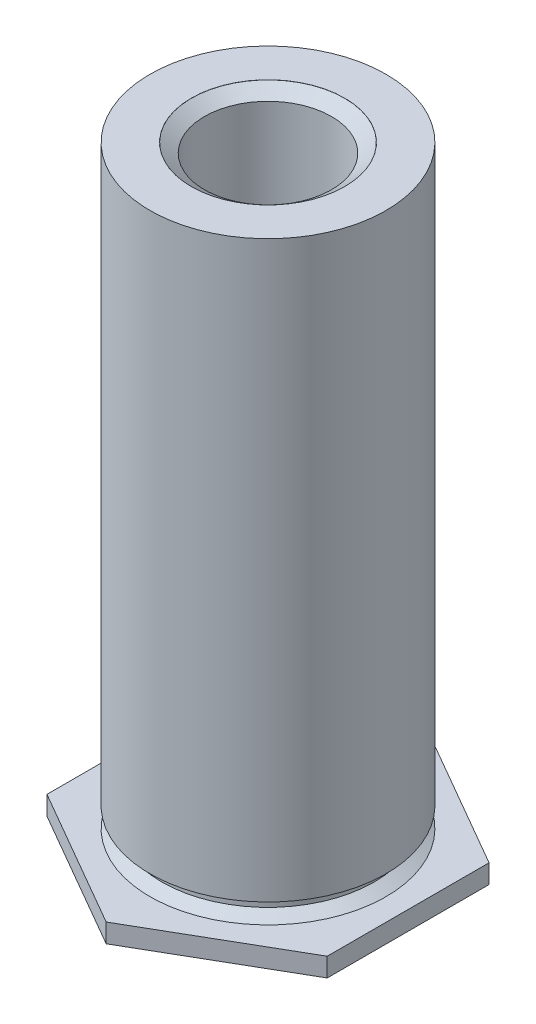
ISO-10303-21;
HEADER;
FILE_DESCRIPTION(('STEP AP214'),'2;1');
FILE_NAME('part.step','',(''),(''),'','','');
FILE_SCHEMA(('AUTOMOTIVE_DESIGN { 1 0 10303 214 1 1 1 1 }'));
ENDSEC;
DATA;
#1=APPLICATION_CONTEXT('core data for automotive mechanical design processes');
#2=APPLICATION_PROTOCOL_DEFINITION('international standard','automotive_design',2000,#1);
#3=PRODUCT_CONTEXT('',#1,'mechanical');
#4=PRODUCT('Part','Part','',(#3));
#5=PRODUCT_RELATED_PRODUCT_CATEGORY('part','',(#4));
#6=PRODUCT_DEFINITION_FORMATION('','',#4);
#7=PRODUCT_DEFINITION_CONTEXT('part definition',#1,'design');
#8=PRODUCT_DEFINITION('design','',#6,#7);
#9=PRODUCT_DEFINITION_SHAPE('','',#8);
#10=(LENGTH_UNIT() NAMED_UNIT(*) SI_UNIT(.MILLI.,.METRE.));
#11=(NAMED_UNIT(*) PLANE_ANGLE_UNIT() SI_UNIT($,.RADIAN.));
#12=(NAMED_UNIT(*) SI_UNIT($,.STERADIAN.) SOLID_ANGLE_UNIT());
#13=UNCERTAINTY_MEASURE_WITH_UNIT(LENGTH_MEASURE(1.E-05),#10,'distance_accuracy_value','');
#14=(GEOMETRIC_REPRESENTATION_CONTEXT(3) GLOBAL_UNCERTAINTY_ASSIGNED_CONTEXT((#13)) GLOBAL_UNIT_ASSIGNED_CONTEXT((#10,
#11,#12)) REPRESENTATION_CONTEXT('',''));
#15=CARTESIAN_POINT('',(0.,0.,0.));
#16=DIRECTION('',(0.,0.,1.));
#17=DIRECTION('',(1.,0.,0.));
#18=AXIS2_PLACEMENT_3D('',#15,#16,#17);
#19=CARTESIAN_POINT('',(3.712,0.4312,0.));
#20=DIRECTION('',(0.,1.,0.));
#21=DIRECTION('',(0.,0.,1.));
#22=AXIS2_PLACEMENT_3D('',#19,#20,#21);
#23=PLANE('',#22);
#24=CARTESIAN_POINT('',(0.,0.4312,0.));
#25=DIRECTION('',(0.,-1.,0.));
#26=DIRECTION('',(0.,0.,-1.));
#27=AXIS2_PLACEMENT_3D('',#24,#25,#26);
#28=CIRCLE('',#27,2.695);
#29=CARTESIAN_POINT('',(0.,0.4312,-2.695));
#30=VERTEX_POINT('',#29);
#31=EDGE_CURVE('E11',#30,#30,#28,.T.);
#32=ORIENTED_EDGE('',*,*,#31,.T.);
#33=EDGE_LOOP('',(#32));
#34=FACE_BOUND('',#33,.T.);
#35=DIRECTION('',(0.866025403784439,0.,0.5));
#36=VECTOR('',#35,1.);
#37=CARTESIAN_POINT('',(0.,0.4312,3.69504172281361));
#38=LINE('',#37,#36);
#39=CARTESIAN_POINT('',(-3.2,0.4312,1.8475208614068));
#40=VERTEX_POINT('',#39);
#41=CARTESIAN_POINT('',(0.,0.4312,3.69504172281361));
#42=VERTEX_POINT('',#41);
#43=EDGE_CURVE('E137',#40,#42,#38,.T.);
#44=ORIENTED_EDGE('',*,*,#43,.T.);
#45=DIRECTION('',(0.866025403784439,0.,-0.5));
#46=VECTOR('',#45,1.);
#47=CARTESIAN_POINT('',(3.2,0.4312,1.8475208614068));
#48=LINE('',#47,#46);
#49=CARTESIAN_POINT('',(3.2,0.4312,1.8475208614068));
#50=VERTEX_POINT('',#49);
#51=EDGE_CURVE('E126',#42,#50,#48,.T.);
#52=ORIENTED_EDGE('',*,*,#51,.T.);
#53=DIRECTION('',(0.,0.,-1.));
#54=VECTOR('',#53,1.);
#55=CARTESIAN_POINT('',(3.2,0.4312,-1.8475208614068));
#56=LINE('',#55,#54);
#57=CARTESIAN_POINT('',(3.2,0.4312,-1.8475208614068));
#58=VERTEX_POINT('',#57);
#59=EDGE_CURVE('E129',#50,#58,#56,.T.);
#60=ORIENTED_EDGE('',*,*,#59,.T.);
#61=DIRECTION('',(-0.866025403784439,0.,-0.5));
#62=VECTOR('',#61,1.);
#63=CARTESIAN_POINT('',(0.,0.4312,-3.69504172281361));
#64=LINE('',#63,#62);
#65=CARTESIAN_POINT('',(0.,0.4312,-3.69504172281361));
#66=VERTEX_POINT('',#65);
#67=EDGE_CURVE('E54',#58,#66,#64,.T.);
#68=ORIENTED_EDGE('',*,*,#67,.T.);
#69=DIRECTION('',(-0.866025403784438,0.,0.5));
#70=VECTOR('',#69,1.);
#71=CARTESIAN_POINT('',(-3.2,0.4312,-1.8475208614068));
#72=LINE('',#71,#70);
#73=CARTESIAN_POINT('',(-3.2,0.4312,-1.8475208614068));
#74=VERTEX_POINT('',#73);
#75=EDGE_CURVE('E102',#66,#74,#72,.T.);
#76=ORIENTED_EDGE('',*,*,#75,.T.);
#77=DIRECTION('',(0.,0.,1.));
#78=VECTOR('',#77,1.);
#79=CARTESIAN_POINT('',(-3.2,0.4312,1.8475208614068));
#80=LINE('',#79,#78);
#81=EDGE_CURVE('E134',#74,#40,#80,.T.);
#82=ORIENTED_EDGE('',*,*,#81,.T.);
#83=EDGE_LOOP('',(#44,#52,#60,#68,#76,#82));
#84=FACE_BOUND('',#83,.T.);
#85=ADVANCED_FACE('F39',(#34,#84),#23,.T.);
#86=CARTESIAN_POINT('',(0.,0.4312,0.));
#87=DIRECTION('',(0.,-1.,0.));
#88=DIRECTION('',(0.,0.,-1.));
#89=AXIS2_PLACEMENT_3D('',#86,#87,#88);
#90=CONICAL_SURFACE('',#89,2.695,1.0471975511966);
#91=CARTESIAN_POINT('',(0.,0.586795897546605,0.));
#92=DIRECTION('',(0.,-1.,0.));
#93=DIRECTION('',(0.,0.,-1.));
#94=AXIS2_PLACEMENT_3D('',#91,#92,#93);
#95=CIRCLE('',#94,2.4255);
#96=CARTESIAN_POINT('',(0.,0.586795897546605,-2.4255));
#97=VERTEX_POINT('',#96);
#98=EDGE_CURVE('E47',#97,#97,#95,.T.);
#99=ORIENTED_EDGE('',*,*,#98,.T.);
#100=EDGE_LOOP('',(#99));
#101=FACE_BOUND('',#100,.T.);
#102=ORIENTED_EDGE('',*,*,#31,.F.);
#103=EDGE_LOOP('',(#102));
#104=FACE_BOUND('',#103,.T.);
#105=ADVANCED_FACE('F177',(#101,#104),#90,.T.);
#106=CARTESIAN_POINT('',(0.,0.,0.));
#107=DIRECTION('',(0.,-1.,0.));
#108=DIRECTION('',(0.,0.,-1.));
#109=AXIS2_PLACEMENT_3D('',#106,#107,#108);
#110=CYLINDRICAL_SURFACE('',#109,2.4255);
#111=CARTESIAN_POINT('',(0.,0.88396,0.));
#112=DIRECTION('',(0.,-1.,0.));
#113=DIRECTION('',(0.,0.,-1.));
#114=AXIS2_PLACEMENT_3D('',#111,#112,#113);
#115=CIRCLE('',#114,2.4255);
#116=CARTESIAN_POINT('',(0.,0.88396,-2.4255));
#117=VERTEX_POINT('',#116);
#118=EDGE_CURVE('E171',#117,#117,#115,.T.);
#119=ORIENTED_EDGE('',*,*,#118,.T.);
#120=EDGE_LOOP('',(#119));
#121=FACE_BOUND('',#120,.T.);
#122=ORIENTED_EDGE('',*,*,#98,.F.);
#123=EDGE_LOOP('',(#122));
#124=FACE_BOUND('',#123,.T.);
#125=ADVANCED_FACE('F180',(#121,#124),#110,.T.);
#126=CARTESIAN_POINT('',(2.695,0.88396,0.));
#127=DIRECTION('',(0.,-1.,0.));
#128=DIRECTION('',(0.,0.,-1.));
#129=AXIS2_PLACEMENT_3D('',#126,#127,#128);
#130=PLANE('',#129);
#131=CARTESIAN_POINT('',(0.,0.88396,0.));
#132=DIRECTION('',(0.,-1.,0.));
#133=DIRECTION('',(0.,0.,-1.));
#134=AXIS2_PLACEMENT_3D('',#131,#132,#133);
#135=CIRCLE('',#134,2.695);
#136=CARTESIAN_POINT('',(0.,0.88396,-2.695));
#137=VERTEX_POINT('',#136);
#138=EDGE_CURVE('E168',#137,#137,#135,.T.);
#139=ORIENTED_EDGE('',*,*,#138,.T.);
#140=EDGE_LOOP('',(#139));
#141=FACE_BOUND('',#140,.T.);
#142=ORIENTED_EDGE('',*,*,#118,.F.);
#143=EDGE_LOOP('',(#142));
#144=FACE_BOUND('',#143,.T.);
#145=ADVANCED_FACE('F182',(#141,#144),#130,.T.);
#146=CARTESIAN_POINT('',(0.,0.,0.));
#147=DIRECTION('',(0.,-1.,0.));
#148=DIRECTION('',(0.,0.,-1.));
#149=AXIS2_PLACEMENT_3D('',#146,#147,#148);
#150=CYLINDRICAL_SURFACE('',#149,2.695);
#151=CARTESIAN_POINT('',(0.,14.,0.));
#152=DIRECTION('',(0.,-1.,0.));
#153=DIRECTION('',(0.,0.,-1.));
#154=AXIS2_PLACEMENT_3D('',#151,#152,#153);
#155=CIRCLE('',#154,2.695);
#156=CARTESIAN_POINT('',(0.,14.,-2.695));
#157=VERTEX_POINT('',#156);
#158=EDGE_CURVE('E165',#157,#157,#155,.T.);
#159=ORIENTED_EDGE('',*,*,#158,.T.);
#160=EDGE_LOOP('',(#159));
#161=FACE_BOUND('',#160,.T.);
#162=ORIENTED_EDGE('',*,*,#138,.F.);
#163=EDGE_LOOP('',(#162));
#164=FACE_BOUND('',#163,.T.);
#165=ADVANCED_FACE('F189',(#161,#164),#150,.T.);
#166=CARTESIAN_POINT('',(2.695,14.,0.));
#167=DIRECTION('',(0.,1.,0.));
#168=DIRECTION('',(0.,0.,1.));
#169=AXIS2_PLACEMENT_3D('',#166,#167,#168);
#170=PLANE('',#169);
#171=CARTESIAN_POINT('',(0.,14.,0.));
#172=DIRECTION('',(0.,1.,0.));
#173=DIRECTION('',(0.,0.,1.));
#174=AXIS2_PLACEMENT_3D('',#171,#172,#173);
#175=CIRCLE('',#174,1.7515);
#176=CARTESIAN_POINT('',(0.,14.,1.7515));
#177=VERTEX_POINT('',#176);
#178=EDGE_CURVE('E42',#177,#177,#175,.T.);
#179=ORIENTED_EDGE('',*,*,#178,.F.);
#180=EDGE_LOOP('',(#179));
#181=FACE_BOUND('',#180,.T.);
#182=ORIENTED_EDGE('',*,*,#158,.F.);
#183=EDGE_LOOP('',(#182));
#184=FACE_BOUND('',#183,.T.);
#185=ADVANCED_FACE('F238',(#181,#184),#170,.T.);
#186=CARTESIAN_POINT('',(1.7515,13.99746,0.));
#187=DIRECTION('',(0.,-1.,0.));
#188=DIRECTION('',(0.,0.,-1.));
#189=AXIS2_PLACEMENT_3D('',#186,#187,#188);
#190=PLANE('',#189);
#191=CARTESIAN_POINT('',(0.,13.99746,0.));
#192=DIRECTION('',(0.,-1.,0.));
#193=DIRECTION('',(0.,0.,-1.));
#194=AXIS2_PLACEMENT_3D('',#191,#192,#193);
#195=CIRCLE('',#194,1.7515);
#196=CARTESIAN_POINT('',(0.,13.99746,-1.7515));
#197=VERTEX_POINT('',#196);
#198=EDGE_CURVE('E142',#197,#197,#195,.T.);
#199=ORIENTED_EDGE('',*,*,#198,.F.);
#200=EDGE_LOOP('',(#199));
#201=FACE_BOUND('',#200,.T.);
#202=CARTESIAN_POINT('',(0.,13.99746,0.));
#203=DIRECTION('',(0.,-1.,0.));
#204=DIRECTION('',(0.,0.,-1.));
#205=AXIS2_PLACEMENT_3D('',#202,#203,#204);
#206=CIRCLE('',#205,1.75);
#207=CARTESIAN_POINT('',(0.,13.99746,-1.75));
#208=VERTEX_POINT('',#207);
#209=EDGE_CURVE('E153',#208,#208,#206,.T.);
#210=ORIENTED_EDGE('',*,*,#209,.T.);
#211=EDGE_LOOP('',(#210));
#212=FACE_BOUND('',#211,.T.);
#213=ADVANCED_FACE('F234',(#201,#212),#190,.F.);
#214=CARTESIAN_POINT('',(0.,13.787475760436,0.));
#215=DIRECTION('',(0.,1.,0.));
#216=DIRECTION('',(0.,0.,1.));
#217=AXIS2_PLACEMENT_3D('',#214,#215,#216);
#218=CONICAL_SURFACE('',#217,1.45,0.960105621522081);
#219=ORIENTED_EDGE('',*,*,#209,.F.);
#220=EDGE_LOOP('',(#219));
#221=FACE_BOUND('',#220,.T.);
#222=CARTESIAN_POINT('',(0.,13.787475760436,0.));
#223=DIRECTION('',(0.,-1.,0.));
#224=DIRECTION('',(0.,0.,-1.));
#225=AXIS2_PLACEMENT_3D('',#222,#223,#224);
#226=CIRCLE('',#225,1.45);
#227=CARTESIAN_POINT('',(0.,13.787475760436,-1.45));
#228=VERTEX_POINT('',#227);
#229=EDGE_CURVE('E150',#228,#228,#226,.T.);
#230=ORIENTED_EDGE('',*,*,#229,.T.);
#231=EDGE_LOOP('',(#230));
#232=FACE_BOUND('',#231,.T.);
#233=ADVANCED_FACE('F230',(#221,#232),#218,.F.);
#234=CARTESIAN_POINT('',(0.,-2.54,0.));
#235=DIRECTION('',(0.,-1.,0.));
#236=DIRECTION('',(0.,0.,-1.));
#237=AXIS2_PLACEMENT_3D('',#234,#235,#236);
#238=CYLINDRICAL_SURFACE('',#237,1.7515);
#239=ORIENTED_EDGE('',*,*,#178,.T.);
#240=EDGE_LOOP('',(#239));
#241=FACE_BOUND('',#240,.T.);
#242=ORIENTED_EDGE('',*,*,#198,.T.);
#243=EDGE_LOOP('',(#242));
#244=FACE_BOUND('',#243,.T.);
#245=ADVANCED_FACE('F226',(#241,#244),#238,.F.);
#246=CARTESIAN_POINT('',(0.,3.39939033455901,0.));
#247=DIRECTION('',(0.,1.,0.));
#248=DIRECTION('',(0.,0.,1.));
#249=AXIS2_PLACEMENT_3D('',#246,#247,#248);
#250=CONICAL_SURFACE('',#249,0.,1.17809724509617);
#251=CARTESIAN_POINT('',(0.,4.,0.));
#252=DIRECTION('',(0.,-1.,0.));
#253=DIRECTION('',(0.,0.,-1.));
#254=AXIS2_PLACEMENT_3D('',#251,#252,#253);
#255=CIRCLE('',#254,1.45);
#256=CARTESIAN_POINT('',(0.,4.,-1.45));
#257=VERTEX_POINT('',#256);
#258=EDGE_CURVE('E156',#257,#257,#255,.T.);
#259=ORIENTED_EDGE('',*,*,#258,.F.);
#260=EDGE_LOOP('',(#259));
#261=FACE_BOUND('',#260,.T.);
#262=CARTESIAN_POINT('',(0.,3.39939033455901,0.));
#263=VERTEX_POINT('',#262);
#264=VERTEX_LOOP('',#263);
#265=FACE_BOUND('',#264,.T.);
#266=ADVANCED_FACE('F229',(#261,#265),#250,.F.);
#267=CARTESIAN_POINT('',(0.,0.,0.));
#268=DIRECTION('',(0.,-1.,0.));
#269=DIRECTION('',(0.,0.,-1.));
#270=AXIS2_PLACEMENT_3D('',#267,#268,#269);
#271=CYLINDRICAL_SURFACE('',#270,1.45);
#272=ORIENTED_EDGE('',*,*,#229,.F.);
#273=EDGE_LOOP('',(#272));
#274=FACE_BOUND('',#273,.T.);
#275=ORIENTED_EDGE('',*,*,#258,.T.);
#276=EDGE_LOOP('',(#275));
#277=FACE_BOUND('',#276,.T.);
#278=ADVANCED_FACE('F225',(#274,#277),#271,.F.);
#279=CARTESIAN_POINT('',(3.2,0.,1.8475208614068));
#280=DIRECTION('',(0.5,0.,0.866025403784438));
#281=DIRECTION('',(0.866025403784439,0.,-0.5));
#282=AXIS2_PLACEMENT_3D('',#279,#280,#281);
#283=PLANE('',#282);
#284=ORIENTED_EDGE('',*,*,#51,.F.);
#285=DIRECTION('',(0.,1.,0.));
#286=VECTOR('',#285,1.);
#287=CARTESIAN_POINT('',(0.,0.,3.69504172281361));
#288=LINE('',#287,#286);
#289=CARTESIAN_POINT('',(0.,0.,3.69504172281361));
#290=VERTEX_POINT('',#289);
#291=EDGE_CURVE('E140',#290,#42,#288,.T.);
#292=ORIENTED_EDGE('',*,*,#291,.F.);
#293=DIRECTION('',(0.866025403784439,0.,-0.5));
#294=VECTOR('',#293,1.);
#295=CARTESIAN_POINT('',(3.2,0.,1.8475208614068));
#296=LINE('',#295,#294);
#297=CARTESIAN_POINT('',(3.2,0.,1.8475208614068));
#298=VERTEX_POINT('',#297);
#299=EDGE_CURVE('E62',#290,#298,#296,.T.);
#300=ORIENTED_EDGE('',*,*,#299,.T.);
#301=DIRECTION('',(0.,1.,0.));
#302=VECTOR('',#301,1.);
#303=CARTESIAN_POINT('',(3.2,0.,1.8475208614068));
#304=LINE('',#303,#302);
#305=EDGE_CURVE('E125',#298,#50,#304,.T.);
#306=ORIENTED_EDGE('',*,*,#305,.T.);
#307=EDGE_LOOP('',(#284,#292,#300,#306));
#308=FACE_BOUND('',#307,.T.);
#309=ADVANCED_FACE('F205',(#308),#283,.T.);
#310=CARTESIAN_POINT('',(0.,0.,3.69504172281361));
#311=DIRECTION('',(-0.5,0.,0.866025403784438));
#312=DIRECTION('',(0.866025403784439,0.,0.5));
#313=AXIS2_PLACEMENT_3D('',#310,#311,#312);
#314=PLANE('',#313);
#315=ORIENTED_EDGE('',*,*,#43,.F.);
#316=DIRECTION('',(0.,1.,0.));
#317=VECTOR('',#316,1.);
#318=CARTESIAN_POINT('',(-3.2,0.,1.8475208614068));
#319=LINE('',#318,#317);
#320=CARTESIAN_POINT('',(-3.2,0.,1.8475208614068));
#321=VERTEX_POINT('',#320);
#322=EDGE_CURVE('E143',#321,#40,#319,.T.);
#323=ORIENTED_EDGE('',*,*,#322,.F.);
#324=DIRECTION('',(0.866025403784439,0.,0.5));
#325=VECTOR('',#324,1.);
#326=CARTESIAN_POINT('',(0.,0.,3.69504172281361));
#327=LINE('',#326,#325);
#328=EDGE_CURVE('E119',#321,#290,#327,.T.);
#329=ORIENTED_EDGE('',*,*,#328,.T.);
#330=ORIENTED_EDGE('',*,*,#291,.T.);
#331=EDGE_LOOP('',(#315,#323,#329,#330));
#332=FACE_BOUND('',#331,.T.);
#333=ADVANCED_FACE('F204',(#332),#314,.T.);
#334=CARTESIAN_POINT('',(-3.2,0.,1.8475208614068));
#335=DIRECTION('',(-1.,0.,0.));
#336=DIRECTION('',(0.,0.,1.));
#337=AXIS2_PLACEMENT_3D('',#334,#335,#336);
#338=PLANE('',#337);
#339=ORIENTED_EDGE('',*,*,#81,.F.);
#340=DIRECTION('',(0.,1.,0.));
#341=VECTOR('',#340,1.);
#342=CARTESIAN_POINT('',(-3.2,0.,-1.8475208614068));
#343=LINE('',#342,#341);
#344=CARTESIAN_POINT('',(-3.2,0.,-1.8475208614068));
#345=VERTEX_POINT('',#344);
#346=EDGE_CURVE('E103',#345,#74,#343,.T.);
#347=ORIENTED_EDGE('',*,*,#346,.F.);
#348=DIRECTION('',(0.,0.,1.));
#349=VECTOR('',#348,1.);
#350=CARTESIAN_POINT('',(-3.2,0.,1.8475208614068));
#351=LINE('',#350,#349);
#352=EDGE_CURVE('E117',#345,#321,#351,.T.);
#353=ORIENTED_EDGE('',*,*,#352,.T.);
#354=ORIENTED_EDGE('',*,*,#322,.T.);
#355=EDGE_LOOP('',(#339,#347,#353,#354));
#356=FACE_BOUND('',#355,.T.);
#357=ADVANCED_FACE('F339',(#356),#338,.T.);
#358=CARTESIAN_POINT('',(-3.2,0.,-1.8475208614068));
#359=DIRECTION('',(-0.5,0.,-0.866025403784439));
#360=DIRECTION('',(-0.866025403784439,0.,0.5));
#361=AXIS2_PLACEMENT_3D('',#358,#359,#360);
#362=PLANE('',#361);
#363=ORIENTED_EDGE('',*,*,#75,.F.);
#364=DIRECTION('',(0.,1.,0.));
#365=VECTOR('',#364,1.);
#366=CARTESIAN_POINT('',(0.,0.,-3.69504172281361));
#367=LINE('',#366,#365);
#368=CARTESIAN_POINT('',(0.,0.,-3.69504172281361));
#369=VERTEX_POINT('',#368);
#370=EDGE_CURVE('E95',#369,#66,#367,.T.);
#371=ORIENTED_EDGE('',*,*,#370,.F.);
#372=DIRECTION('',(-0.866025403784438,0.,0.5));
#373=VECTOR('',#372,1.);
#374=CARTESIAN_POINT('',(-3.2,0.,-1.8475208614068));
#375=LINE('',#374,#373);
#376=EDGE_CURVE('E99',#369,#345,#375,.T.);
#377=ORIENTED_EDGE('',*,*,#376,.T.);
#378=ORIENTED_EDGE('',*,*,#346,.T.);
#379=EDGE_LOOP('',(#363,#371,#377,#378));
#380=FACE_BOUND('',#379,.T.);
#381=ADVANCED_FACE('F97',(#380),#362,.T.);
#382=CARTESIAN_POINT('',(0.,0.,-3.69504172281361));
#383=DIRECTION('',(0.5,0.,-0.866025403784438));
#384=DIRECTION('',(-0.866025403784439,0.,-0.5));
#385=AXIS2_PLACEMENT_3D('',#382,#383,#384);
#386=PLANE('',#385);
#387=ORIENTED_EDGE('',*,*,#67,.F.);
#388=DIRECTION('',(0.,1.,0.));
#389=VECTOR('',#388,1.);
#390=CARTESIAN_POINT('',(3.2,0.,-1.8475208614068));
#391=LINE('',#390,#389);
#392=CARTESIAN_POINT('',(3.2,0.,-1.8475208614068));
#393=VERTEX_POINT('',#392);
#394=EDGE_CURVE('E104',#393,#58,#391,.T.);
#395=ORIENTED_EDGE('',*,*,#394,.F.);
#396=DIRECTION('',(-0.866025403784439,0.,-0.5));
#397=VECTOR('',#396,1.);
#398=CARTESIAN_POINT('',(0.,0.,-3.69504172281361));
#399=LINE('',#398,#397);
#400=EDGE_CURVE('E107',#393,#369,#399,.T.);
#401=ORIENTED_EDGE('',*,*,#400,.T.);
#402=ORIENTED_EDGE('',*,*,#370,.T.);
#403=EDGE_LOOP('',(#387,#395,#401,#402));
#404=FACE_BOUND('',#403,.T.);
#405=ADVANCED_FACE('F108',(#404),#386,.T.);
#406=CARTESIAN_POINT('',(3.2,0.,-1.8475208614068));
#407=DIRECTION('',(1.,0.,0.));
#408=DIRECTION('',(0.,0.,-1.));
#409=AXIS2_PLACEMENT_3D('',#406,#407,#408);
#410=PLANE('',#409);
#411=ORIENTED_EDGE('',*,*,#59,.F.);
#412=ORIENTED_EDGE('',*,*,#305,.F.);
#413=DIRECTION('',(0.,0.,-1.));
#414=VECTOR('',#413,1.);
#415=CARTESIAN_POINT('',(3.2,0.,-1.8475208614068));
#416=LINE('',#415,#414);
#417=EDGE_CURVE('E112',#298,#393,#416,.T.);
#418=ORIENTED_EDGE('',*,*,#417,.T.);
#419=ORIENTED_EDGE('',*,*,#394,.T.);
#420=EDGE_LOOP('',(#411,#412,#418,#419));
#421=FACE_BOUND('',#420,.T.);
#422=ADVANCED_FACE('F208',(#421),#410,.T.);
#423=CARTESIAN_POINT('',(2.695,0.00253999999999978,0.));
#424=DIRECTION('',(0.,-1.,0.));
#425=DIRECTION('',(0.,0.,-1.));
#426=AXIS2_PLACEMENT_3D('',#423,#424,#425);
#427=PLANE('',#426);
#428=CARTESIAN_POINT('',(0.,0.00254,0.));
#429=DIRECTION('',(0.,-1.,0.));
#430=DIRECTION('',(0.,0.,-1.));
#431=AXIS2_PLACEMENT_3D('',#428,#429,#430);
#432=CIRCLE('',#431,2.695);
#433=CARTESIAN_POINT('',(0.,0.00254,-2.695));
#434=VERTEX_POINT('',#433);
#435=EDGE_CURVE('E162',#434,#434,#432,.T.);
#436=ORIENTED_EDGE('',*,*,#435,.T.);
#437=EDGE_LOOP('',(#436));
#438=FACE_BOUND('',#437,.T.);
#439=ADVANCED_FACE('F211',(#438),#427,.T.);
#440=CARTESIAN_POINT('',(0.,0.,0.));
#441=DIRECTION('',(0.,-1.,0.));
#442=DIRECTION('',(0.,0.,-1.));
#443=AXIS2_PLACEMENT_3D('',#440,#441,#442);
#444=CYLINDRICAL_SURFACE('',#443,2.695);
#445=CARTESIAN_POINT('',(0.,0.,0.));
#446=DIRECTION('',(0.,-1.,0.));
#447=DIRECTION('',(0.,0.,-1.));
#448=AXIS2_PLACEMENT_3D('',#445,#446,#447);
#449=CIRCLE('',#448,2.695);
#450=CARTESIAN_POINT('',(0.,0.,-2.695));
#451=VERTEX_POINT('',#450);
#452=EDGE_CURVE('E159',#451,#451,#449,.T.);
#453=ORIENTED_EDGE('',*,*,#452,.T.);
#454=EDGE_LOOP('',(#453));
#455=FACE_BOUND('',#454,.T.);
#456=ORIENTED_EDGE('',*,*,#435,.F.);
#457=EDGE_LOOP('',(#456));
#458=FACE_BOUND('',#457,.T.);
#459=ADVANCED_FACE('F218',(#455,#458),#444,.F.);
#460=CARTESIAN_POINT('',(2.695,0.,0.));
#461=DIRECTION('',(0.,-1.,0.));
#462=DIRECTION('',(0.,0.,-1.));
#463=AXIS2_PLACEMENT_3D('',#460,#461,#462);
#464=PLANE('',#463);
#465=ORIENTED_EDGE('',*,*,#452,.F.);
#466=EDGE_LOOP('',(#465));
#467=FACE_BOUND('',#466,.T.);
#468=ORIENTED_EDGE('',*,*,#417,.F.);
#469=ORIENTED_EDGE('',*,*,#299,.F.);
#470=ORIENTED_EDGE('',*,*,#328,.F.);
#471=ORIENTED_EDGE('',*,*,#352,.F.);
#472=ORIENTED_EDGE('',*,*,#376,.F.);
#473=ORIENTED_EDGE('',*,*,#400,.F.);
#474=EDGE_LOOP('',(#468,#469,#470,#471,#472,#473));
#475=FACE_BOUND('',#474,.T.);
#476=ADVANCED_FACE('F114',(#467,#475),#464,.T.);
#477=CLOSED_SHELL('',(#85,#105,#125,#145,#165,#185,#213,#233,#245,#266,#278,#309,#333,#357,#381,
#405,#422,#439,#459,#476));
#478=MANIFOLD_SOLID_BREP('B2',#477);
#479=ADVANCED_BREP_SHAPE_REPRESENTATION('',(#18,#478),#14);
#480=SHAPE_DEFINITION_REPRESENTATION(#9,#479);
ENDSEC;
END-ISO-10303-21;
